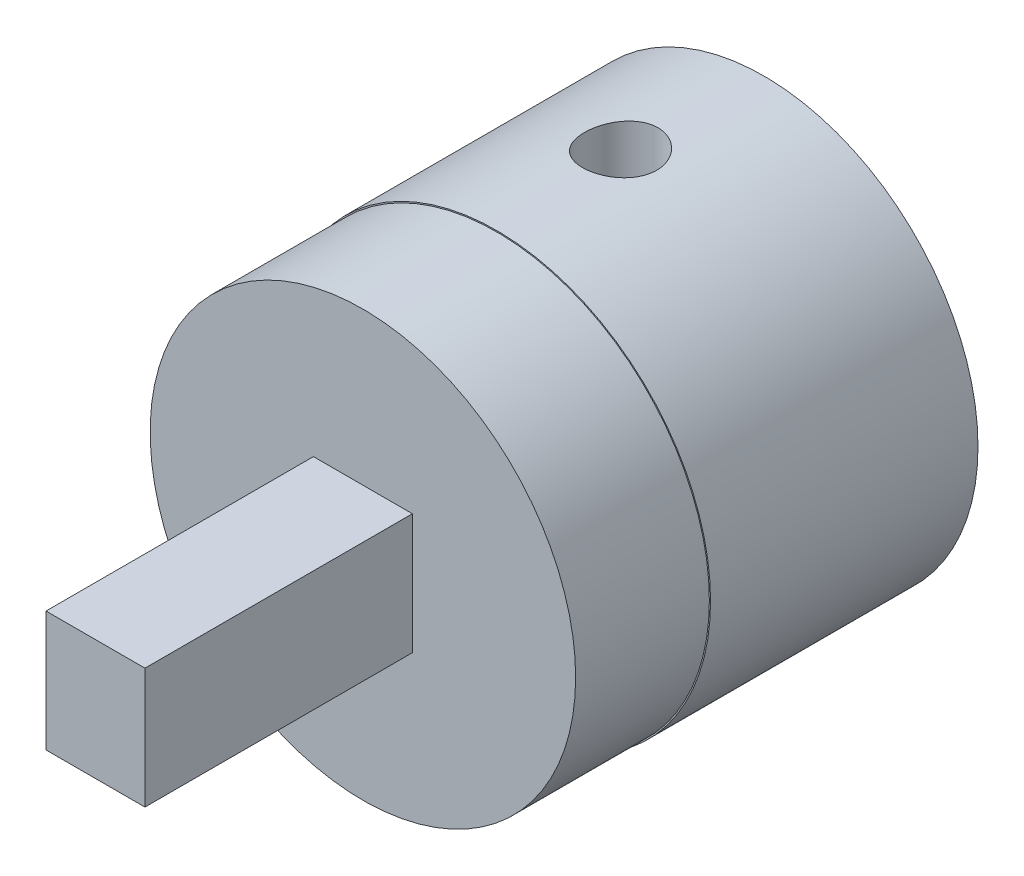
ISO-10303-21;
HEADER;
FILE_DESCRIPTION(('STEP AP214'),'2;1');
FILE_NAME('part.step','',(''),(''),'','','');
FILE_SCHEMA(('AUTOMOTIVE_DESIGN { 1 0 10303 214 1 1 1 1 }'));
ENDSEC;
DATA;
#1=APPLICATION_CONTEXT('core data for automotive mechanical design processes');
#2=APPLICATION_PROTOCOL_DEFINITION('international standard','automotive_design',2000,#1);
#3=PRODUCT_CONTEXT('',#1,'mechanical');
#4=PRODUCT('Part','Part','',(#3));
#5=PRODUCT_RELATED_PRODUCT_CATEGORY('part','',(#4));
#6=PRODUCT_DEFINITION_FORMATION('','',#4);
#7=PRODUCT_DEFINITION_CONTEXT('part definition',#1,'design');
#8=PRODUCT_DEFINITION('design','',#6,#7);
#9=PRODUCT_DEFINITION_SHAPE('','',#8);
#10=(LENGTH_UNIT() NAMED_UNIT(*) SI_UNIT(.MILLI.,.METRE.));
#11=(NAMED_UNIT(*) PLANE_ANGLE_UNIT() SI_UNIT($,.RADIAN.));
#12=(NAMED_UNIT(*) SI_UNIT($,.STERADIAN.) SOLID_ANGLE_UNIT());
#13=UNCERTAINTY_MEASURE_WITH_UNIT(LENGTH_MEASURE(1.E-05),#10,'distance_accuracy_value','');
#14=(GEOMETRIC_REPRESENTATION_CONTEXT(3) GLOBAL_UNCERTAINTY_ASSIGNED_CONTEXT((#13)) GLOBAL_UNIT_ASSIGNED_CONTEXT((#10,
#11,#12)) REPRESENTATION_CONTEXT('',''));
#15=CARTESIAN_POINT('',(0.,0.,0.));
#16=DIRECTION('',(0.,0.,1.));
#17=DIRECTION('',(1.,0.,0.));
#18=AXIS2_PLACEMENT_3D('',#15,#16,#17);
#19=CARTESIAN_POINT('',(-4.76133772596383,0.905324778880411,15.));
#20=DIRECTION('',(0.,0.,1.));
#21=DIRECTION('',(1.,0.,0.));
#22=AXIS2_PLACEMENT_3D('',#19,#20,#21);
#23=PLANE('',#22);
#24=CARTESIAN_POINT('',(-4.76133772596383,0.905324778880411,15.));
#25=DIRECTION('',(0.,0.,1.));
#26=DIRECTION('',(1.,0.,0.));
#27=AXIS2_PLACEMENT_3D('',#24,#25,#26);
#28=CIRCLE('',#27,7.95500000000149);
#29=CARTESIAN_POINT('',(3.19366227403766,0.905324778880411,15.));
#30=VERTEX_POINT('',#29);
#31=EDGE_CURVE('E119',#30,#30,#28,.T.);
#32=ORIENTED_EDGE('',*,*,#31,.T.);
#33=EDGE_LOOP('',(#32));
#34=FACE_BOUND('',#33,.T.);
#35=DIRECTION('',(-1.,0.,0.));
#36=VECTOR('',#35,1.);
#37=CARTESIAN_POINT('',(-6.61133772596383,3.15532477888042,15.));
#38=LINE('',#37,#36);
#39=CARTESIAN_POINT('',(-2.91133772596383,3.15532477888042,15.));
#40=VERTEX_POINT('',#39);
#41=CARTESIAN_POINT('',(-6.61133772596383,3.15532477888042,15.));
#42=VERTEX_POINT('',#41);
#43=EDGE_CURVE('E96',#40,#42,#38,.T.);
#44=ORIENTED_EDGE('',*,*,#43,.F.);
#45=DIRECTION('',(0.,1.,0.));
#46=VECTOR('',#45,1.);
#47=CARTESIAN_POINT('',(-2.91133772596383,3.15532477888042,15.));
#48=LINE('',#47,#46);
#49=CARTESIAN_POINT('',(-2.91133772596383,-1.34467522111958,15.));
#50=VERTEX_POINT('',#49);
#51=EDGE_CURVE('E107',#50,#40,#48,.T.);
#52=ORIENTED_EDGE('',*,*,#51,.F.);
#53=DIRECTION('',(1.,0.,0.));
#54=VECTOR('',#53,1.);
#55=CARTESIAN_POINT('',(-6.61133772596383,-1.34467522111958,15.));
#56=LINE('',#55,#54);
#57=CARTESIAN_POINT('',(-6.61133772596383,-1.34467522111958,15.));
#58=VERTEX_POINT('',#57);
#59=EDGE_CURVE('E77',#58,#50,#56,.T.);
#60=ORIENTED_EDGE('',*,*,#59,.F.);
#61=DIRECTION('',(0.,-1.,0.));
#62=VECTOR('',#61,1.);
#63=CARTESIAN_POINT('',(-6.61133772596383,3.15532477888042,15.));
#64=LINE('',#63,#62);
#65=EDGE_CURVE('E112',#42,#58,#64,.T.);
#66=ORIENTED_EDGE('',*,*,#65,.F.);
#67=EDGE_LOOP('',(#44,#52,#60,#66));
#68=FACE_BOUND('',#67,.T.);
#69=ADVANCED_FACE('F33',(#34,#68),#23,.T.);
#70=CARTESIAN_POINT('',(-4.76133772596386,0.905324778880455,10.));
#71=DIRECTION('',(0.,0.,1.));
#72=DIRECTION('',(1.,0.,0.));
#73=AXIS2_PLACEMENT_3D('',#70,#71,#72);
#74=PLANE('',#73);
#75=CARTESIAN_POINT('',(-4.76133772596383,0.905324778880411,10.));
#76=DIRECTION('',(0.,0.,1.));
#77=DIRECTION('',(1.,0.,0.));
#78=AXIS2_PLACEMENT_3D('',#75,#76,#77);
#79=CIRCLE('',#78,7.95500000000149);
#80=CARTESIAN_POINT('',(3.19366227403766,0.905324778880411,10.));
#81=VERTEX_POINT('',#80);
#82=EDGE_CURVE('E118',#81,#81,#79,.T.);
#83=ORIENTED_EDGE('',*,*,#82,.F.);
#84=EDGE_LOOP('',(#83));
#85=FACE_BOUND('',#84,.T.);
#86=CARTESIAN_POINT('',(-4.76133772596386,0.905324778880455,10.));
#87=DIRECTION('',(0.,0.,1.));
#88=DIRECTION('',(1.,0.,0.));
#89=AXIS2_PLACEMENT_3D('',#86,#87,#88);
#90=CIRCLE('',#89,8.);
#91=CARTESIAN_POINT('',(3.23866227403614,0.905324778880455,10.));
#92=VERTEX_POINT('',#91);
#93=EDGE_CURVE('E11',#92,#92,#90,.T.);
#94=ORIENTED_EDGE('',*,*,#93,.T.);
#95=EDGE_LOOP('',(#94));
#96=FACE_BOUND('',#95,.T.);
#97=ADVANCED_FACE('F172',(#85,#96),#74,.T.);
#98=CARTESIAN_POINT('',(-4.76133772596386,0.905324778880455,0.));
#99=DIRECTION('',(0.,0.,1.));
#100=DIRECTION('',(1.,0.,0.));
#101=AXIS2_PLACEMENT_3D('',#98,#99,#100);
#102=PLANE('',#101);
#103=CARTESIAN_POINT('',(-4.76133772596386,0.905324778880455,0.));
#104=DIRECTION('',(0.,0.,1.));
#105=DIRECTION('',(1.,0.,0.));
#106=AXIS2_PLACEMENT_3D('',#103,#104,#105);
#107=CIRCLE('',#106,8.);
#108=CARTESIAN_POINT('',(3.23866227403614,0.905324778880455,0.));
#109=VERTEX_POINT('',#108);
#110=EDGE_CURVE('E47',#109,#109,#107,.T.);
#111=ORIENTED_EDGE('',*,*,#110,.F.);
#112=EDGE_LOOP('',(#111));
#113=FACE_BOUND('',#112,.T.);
#114=CARTESIAN_POINT('',(-4.76133772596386,0.905324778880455,0.));
#115=DIRECTION('',(0.,0.,1.));
#116=DIRECTION('',(1.,0.,0.));
#117=AXIS2_PLACEMENT_3D('',#114,#115,#116);
#118=CIRCLE('',#117,3.);
#119=CARTESIAN_POINT('',(-1.76133772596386,0.905324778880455,0.));
#120=VERTEX_POINT('',#119);
#121=EDGE_CURVE('E127',#120,#120,#118,.T.);
#122=ORIENTED_EDGE('',*,*,#121,.T.);
#123=EDGE_LOOP('',(#122));
#124=FACE_BOUND('',#123,.T.);
#125=ADVANCED_FACE('F163',(#113,#124),#102,.F.);
#126=CARTESIAN_POINT('',(-4.76133772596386,0.905324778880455,10.));
#127=DIRECTION('',(0.,0.,-1.));
#128=DIRECTION('',(-1.,0.,0.));
#129=AXIS2_PLACEMENT_3D('',#126,#127,#128);
#130=CYLINDRICAL_SURFACE('',#129,8.);
#131=CARTESIAN_POINT('',(-5.12734854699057,-7.08629809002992,6.35));
#132=CARTESIAN_POINT('',(-5.0523915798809,-7.08972983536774,6.34999712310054));
#133=CARTESIAN_POINT('',(-4.97734751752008,-7.09210038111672,6.34373650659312));
#134=CARTESIAN_POINT('',(-4.82926426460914,-7.09473049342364,6.3188223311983));
#135=CARTESIAN_POINT('',(-4.75622677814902,-7.09498831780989,6.30015855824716));
#136=CARTESIAN_POINT('',(-4.6143240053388,-7.09363892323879,6.25097556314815));
#137=CARTESIAN_POINT('',(-4.54545627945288,-7.09203280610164,6.22046335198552));
#138=CARTESIAN_POINT('',(-4.41378964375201,-7.08739415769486,6.14846177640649));
#139=CARTESIAN_POINT('',(-4.35099008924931,-7.08436177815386,6.10697357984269));
#140=CARTESIAN_POINT('',(-4.23284674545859,-7.07742060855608,6.01392862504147));
#141=CARTESIAN_POINT('',(-4.1775459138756,-7.07350708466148,5.96231768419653));
#142=CARTESIAN_POINT('',(-4.07632575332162,-7.06545579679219,5.8506074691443));
#143=CARTESIAN_POINT('',(-4.0304070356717,-7.06131801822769,5.79050764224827));
#144=CARTESIAN_POINT('',(-3.9488941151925,-7.0534208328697,5.66296188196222));
#145=CARTESIAN_POINT('',(-3.913385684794,-7.04966472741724,5.59546088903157));
#146=CARTESIAN_POINT('',(-3.85421025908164,-7.04313489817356,5.45540916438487));
#147=CARTESIAN_POINT('',(-3.83054294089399,-7.04036114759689,5.38285857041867));
#148=CARTESIAN_POINT('',(-3.79579945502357,-7.0362143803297,5.23500196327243));
#149=CARTESIAN_POINT('',(-3.78468416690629,-7.03483701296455,5.15970527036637));
#150=CARTESIAN_POINT('',(-3.77524522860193,-7.03367045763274,5.00830381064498));
#151=CARTESIAN_POINT('',(-3.77692104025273,-7.03388120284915,4.93219907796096));
#152=CARTESIAN_POINT('',(-3.79296205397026,-7.03585342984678,4.78183938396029));
#153=CARTESIAN_POINT('',(-3.80724863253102,-7.037605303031,4.70757588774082));
#154=CARTESIAN_POINT('',(-3.84798305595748,-7.0423918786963,4.56250657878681));
#155=CARTESIAN_POINT('',(-3.8744312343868,-7.0454266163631,4.49170086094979));
#156=CARTESIAN_POINT('',(-3.93882391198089,-7.05234556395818,4.355319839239));
#157=CARTESIAN_POINT('',(-3.97680163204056,-7.05623221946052,4.28976035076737));
#158=CARTESIAN_POINT('',(-4.06316106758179,-7.06426893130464,4.16591081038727));
#159=CARTESIAN_POINT('',(-4.11154327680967,-7.06841900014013,4.10762110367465));
#160=CARTESIAN_POINT('',(-4.21771895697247,-7.07636201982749,3.9995765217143));
#161=CARTESIAN_POINT('',(-4.27557094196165,-7.08015250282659,3.949878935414));
#162=CARTESIAN_POINT('',(-4.39884627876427,-7.0866964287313,3.86089391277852));
#163=CARTESIAN_POINT('',(-4.46426942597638,-7.08944989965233,3.82160619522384));
#164=CARTESIAN_POINT('',(-4.60059898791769,-7.09334960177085,3.75469667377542));
#165=CARTESIAN_POINT('',(-4.67148575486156,-7.09450133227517,3.72703518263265));
#166=CARTESIAN_POINT('',(-4.81689722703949,-7.09481236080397,3.68399539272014));
#167=CARTESIAN_POINT('',(-4.89142165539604,-7.09397181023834,3.66861616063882));
#168=CARTESIAN_POINT('',(-5.04118661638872,-7.09012638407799,3.65066390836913));
#169=CARTESIAN_POINT('',(-5.11641265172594,-7.08714312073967,3.64796502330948));
#170=CARTESIAN_POINT('',(-5.26615655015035,-7.0790838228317,3.6550646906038));
#171=CARTESIAN_POINT('',(-5.34067441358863,-7.07400778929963,3.66486323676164));
#172=CARTESIAN_POINT('',(-5.48695554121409,-7.06203803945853,3.69662431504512));
#173=CARTESIAN_POINT('',(-5.55871731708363,-7.05514335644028,3.71859332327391));
#174=CARTESIAN_POINT('',(-5.69750330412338,-7.04001800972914,3.77402744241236));
#175=CARTESIAN_POINT('',(-5.76452707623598,-7.03178722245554,3.80749361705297));
#176=CARTESIAN_POINT('',(-5.89299416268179,-7.0144996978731,3.88554180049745));
#177=CARTESIAN_POINT('',(-5.95434243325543,-7.00543271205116,3.93027800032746));
#178=CARTESIAN_POINT('',(-6.06869843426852,-6.9873405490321,4.02938862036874));
#179=CARTESIAN_POINT('',(-6.12170547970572,-6.97831537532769,4.08376383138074));
#180=CARTESIAN_POINT('',(-6.21840044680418,-6.96102192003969,4.20128120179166));
#181=CARTESIAN_POINT('',(-6.26199154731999,-6.95276195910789,4.26450435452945));
#182=CARTESIAN_POINT('',(-6.33790248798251,-6.9378854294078,4.39756765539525));
#183=CARTESIAN_POINT('',(-6.37022321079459,-6.93126873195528,4.46740728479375));
#184=CARTESIAN_POINT('',(-6.42228298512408,-6.9203997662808,4.6108955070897));
#185=CARTESIAN_POINT('',(-6.44216193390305,-6.91612127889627,4.68449129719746));
#186=CARTESIAN_POINT('',(-6.46926712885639,-6.91024770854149,4.83407828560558));
#187=CARTESIAN_POINT('',(-6.47649517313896,-6.90865224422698,4.91006914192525));
#188=CARTESIAN_POINT('',(-6.47804353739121,-6.90831204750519,5.06064669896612));
#189=CARTESIAN_POINT('',(-6.4726216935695,-6.90951037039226,5.13523074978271));
#190=CARTESIAN_POINT('',(-6.44958123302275,-6.91451988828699,5.28239663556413));
#191=CARTESIAN_POINT('',(-6.43196274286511,-6.91833105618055,5.35497849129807));
#192=CARTESIAN_POINT('',(-6.38512835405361,-6.92818469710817,5.49598389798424));
#193=CARTESIAN_POINT('',(-6.35593337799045,-6.93422314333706,5.56441469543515));
#194=CARTESIAN_POINT('',(-6.28681185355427,-6.94796530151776,5.69543691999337));
#195=CARTESIAN_POINT('',(-6.246884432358,-6.95566914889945,5.75802787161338));
#196=CARTESIAN_POINT('',(-6.15656240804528,-6.97220589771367,5.8768655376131));
#197=CARTESIAN_POINT('',(-6.10598503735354,-6.98105731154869,5.93297076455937));
#198=CARTESIAN_POINT('',(-5.9962072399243,-6.99898953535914,6.03597858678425));
#199=CARTESIAN_POINT('',(-5.93700443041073,-7.00807040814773,6.08287863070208));
#200=CARTESIAN_POINT('',(-5.81061466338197,-7.02582567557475,6.16682917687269));
#201=CARTESIAN_POINT('',(-5.74332077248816,-7.03449187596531,6.20372049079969));
#202=CARTESIAN_POINT('',(-5.60337390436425,-7.05054835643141,6.26559951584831));
#203=CARTESIAN_POINT('',(-5.53072609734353,-7.05793984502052,6.29059854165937));
#204=CARTESIAN_POINT('',(-5.4027714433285,-7.06910174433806,6.32276649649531));
#205=CARTESIAN_POINT('',(-5.34824263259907,-7.07330790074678,6.3329574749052));
#206=CARTESIAN_POINT('',(-5.2382746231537,-7.08063588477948,6.34657520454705));
#207=CARTESIAN_POINT('',(-5.18283544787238,-7.08375774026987,6.35000212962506));
#208=CARTESIAN_POINT('',(-5.12734854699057,-7.08629809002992,6.35));
#209=B_SPLINE_CURVE_WITH_KNOTS('',3,(#131,#132,#133,#134,#135,#136,#137,#138,#139,#140,#141,
#142,#143,#144,#145,#146,#147,#148,#149,#150,#151,#152,#153,#154,#155,#156,#157,#158,#159,#160,
#161,#162,#163,#164,#165,#166,#167,#168,#169,#170,#171,#172,#173,#174,#175,#176,#177,#178,#179,
#180,#181,#182,#183,#184,#185,#186,#187,#188,#189,#190,#191,#192,#193,#194,#195,#196,#197,#198,
#199,#200,#201,#202,#203,#204,#205,#206,#207,#208),.UNSPECIFIED.,.T.,.F.,(4,2,2,2,2,2,2,2,2,2,2,
2,2,2,2,2,2,2,2,2,2,2,2,2,2,2,2,2,2,2,2,2,2,2,2,2,2,2,4),(0.,0.22490521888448,0.449995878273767,
0.674953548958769,0.899887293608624,1.12605959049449,1.35224661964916,1.58024800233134,
1.808243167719,2.03552577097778,2.26279881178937,2.4886648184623,2.71453702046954,
2.94106632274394,3.16760637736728,3.395603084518,3.62359363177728,3.85079946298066,
4.07798802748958,4.3029166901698,4.5278452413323,4.75289359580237,4.97796277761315,
5.20629652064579,5.434649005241,5.66524822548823,5.89582938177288,6.12376893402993,
6.35167608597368,6.57497861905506,6.79827883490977,7.02117729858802,7.24409389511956,
7.47120372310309,7.69837640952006,7.92897469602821,8.15935314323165,8.32584352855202,
8.49232963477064),.UNSPECIFIED.);
#210=CARTESIAN_POINT('',(-5.12734854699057,-7.08629809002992,6.35));
#211=VERTEX_POINT('',#210);
#212=EDGE_CURVE('E110',#211,#211,#209,.T.);
#213=ORIENTED_EDGE('',*,*,#212,.T.);
#214=EDGE_LOOP('',(#213));
#215=FACE_BOUND('',#214,.T.);
#216=CARTESIAN_POINT('',(-5.12734854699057,8.89694764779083,6.35));
#217=CARTESIAN_POINT('',(-5.20301961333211,8.89348059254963,6.34999688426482));
#218=CARTESIAN_POINT('',(-5.27868412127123,8.88892822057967,6.34361594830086));
#219=CARTESIAN_POINT('',(-5.42778941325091,8.8778681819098,6.31831907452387));
#220=CARTESIAN_POINT('',(-5.5012278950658,8.87135856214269,6.29939059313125));
#221=CARTESIAN_POINT('',(-5.64370840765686,8.85683696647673,6.24962375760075));
#222=CARTESIAN_POINT('',(-5.71275485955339,8.8488265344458,6.21879760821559));
#223=CARTESIAN_POINT('',(-5.84465456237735,8.83191620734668,6.14614226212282));
#224=CARTESIAN_POINT('',(-5.90750854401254,8.82301641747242,6.10431436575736));
#225=CARTESIAN_POINT('',(-6.02603822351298,8.80495592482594,6.01026939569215));
#226=CARTESIAN_POINT('',(-6.08162475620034,8.79579340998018,5.95794023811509));
#227=CARTESIAN_POINT('',(-6.18324977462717,8.77811546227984,5.84460980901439));
#228=CARTESIAN_POINT('',(-6.22928774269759,8.76960006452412,5.78360806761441));
#229=CARTESIAN_POINT('',(-6.31060099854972,8.75398760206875,5.65441111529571));
#230=CARTESIAN_POINT('',(-6.34584779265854,8.74689430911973,5.58619748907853));
#231=CARTESIAN_POINT('',(-6.40432649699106,8.73485129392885,5.44462430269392));
#232=CARTESIAN_POINT('',(-6.42755995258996,8.72990129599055,5.37126540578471));
#233=CARTESIAN_POINT('',(-6.46095449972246,8.72271513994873,5.22287934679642));
#234=CARTESIAN_POINT('',(-6.47134133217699,8.72043215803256,5.14790526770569));
#235=CARTESIAN_POINT('',(-6.47945127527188,8.71865343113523,4.99724631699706));
#236=CARTESIAN_POINT('',(-6.47717576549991,8.71915738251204,4.92156152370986));
#237=CARTESIAN_POINT('',(-6.46017788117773,8.722870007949,4.77289762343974));
#238=CARTESIAN_POINT('',(-6.44565372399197,8.72603560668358,4.69989463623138));
#239=CARTESIAN_POINT('',(-6.40488078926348,8.7347051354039,4.55738866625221));
#240=CARTESIAN_POINT('',(-6.37863148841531,8.74020916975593,4.48788583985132));
#241=CARTESIAN_POINT('',(-6.31495460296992,8.75308447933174,4.35374427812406));
#242=CARTESIAN_POINT('',(-6.27744346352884,8.76046964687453,4.28914658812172));
#243=CARTESIAN_POINT('',(-6.19238640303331,8.77640898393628,4.16709604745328));
#244=CARTESIAN_POINT('',(-6.14483925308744,8.78496329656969,4.10964407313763));
#245=CARTESIAN_POINT('',(-6.0399113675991,8.80267446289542,4.0022627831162));
#246=CARTESIAN_POINT('',(-5.98234745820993,8.81184012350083,3.95251379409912));
#247=CARTESIAN_POINT('',(-5.85965437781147,8.82981461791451,3.86334709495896));
#248=CARTESIAN_POINT('',(-5.794524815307,8.8386234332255,3.82392991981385));
#249=CARTESIAN_POINT('',(-5.65796474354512,8.85521905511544,3.75629870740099));
#250=CARTESIAN_POINT('',(-5.58649210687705,8.86299801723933,3.7281676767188));
#251=CARTESIAN_POINT('',(-5.4396630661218,8.87685581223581,3.68439103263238));
#252=CARTESIAN_POINT('',(-5.36430699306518,8.88293478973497,3.66874435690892));
#253=CARTESIAN_POINT('',(-5.21285461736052,8.89292882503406,3.65058080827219));
#254=CARTESIAN_POINT('',(-5.1367796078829,8.89687018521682,3.64790097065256));
#255=CARTESIAN_POINT('',(-4.98518035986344,8.90255224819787,3.65536380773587));
#256=CARTESIAN_POINT('',(-4.90965607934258,8.90429312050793,3.66550549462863));
#257=CARTESIAN_POINT('',(-4.76230154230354,8.90566003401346,3.6981304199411));
#258=CARTESIAN_POINT('',(-4.69043684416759,8.90531231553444,3.72045733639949));
#259=CARTESIAN_POINT('',(-4.55143258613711,8.90287292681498,3.7767082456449));
#260=CARTESIAN_POINT('',(-4.48429312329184,8.90078122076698,3.81063247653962));
#261=CARTESIAN_POINT('',(-4.35641883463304,8.89532816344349,3.88922707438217));
#262=CARTESIAN_POINT('',(-4.29570335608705,8.89196310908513,3.93392864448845));
#263=CARTESIAN_POINT('',(-4.18256406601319,8.88456293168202,4.03277412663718));
#264=CARTESIAN_POINT('',(-4.13014076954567,8.88052776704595,4.08691862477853));
#265=CARTESIAN_POINT('',(-4.03454515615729,8.872388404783,4.20373826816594));
#266=CARTESIAN_POINT('',(-3.99146933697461,8.86828391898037,4.2664923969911));
#267=CARTESIAN_POINT('',(-3.91644325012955,8.86067399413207,4.3983662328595));
#268=CARTESIAN_POINT('',(-3.88449296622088,8.85716855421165,4.46748593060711));
#269=CARTESIAN_POINT('',(-3.83261408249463,8.85127716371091,4.61021435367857));
#270=CARTESIAN_POINT('',(-3.81269583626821,8.84889217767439,4.68382688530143));
#271=CARTESIAN_POINT('',(-3.78551592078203,8.84559946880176,4.83338366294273));
#272=CARTESIAN_POINT('',(-3.77825363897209,8.84469167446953,4.90932779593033));
#273=CARTESIAN_POINT('',(-3.77660833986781,8.84448773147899,5.06082886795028));
#274=CARTESIAN_POINT('',(-3.78213635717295,8.84518045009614,5.13638483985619));
#275=CARTESIAN_POINT('',(-3.80572252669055,8.84805343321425,5.28548476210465));
#276=CARTESIAN_POINT('',(-3.82378071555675,8.85023370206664,5.35902870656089));
#277=CARTESIAN_POINT('',(-3.87188099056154,8.85576173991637,5.50198109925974));
#278=CARTESIAN_POINT('',(-3.90191485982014,8.85910870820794,5.57139234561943));
#279=CARTESIAN_POINT('',(-3.97311086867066,8.8664788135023,5.70421111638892));
#280=CARTESIAN_POINT('',(-4.01427327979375,8.87050196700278,5.76761849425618));
#281=CARTESIAN_POINT('',(-4.10689954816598,8.87864784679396,5.88709431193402));
#282=CARTESIAN_POINT('',(-4.15843179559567,8.88277106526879,5.94310970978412));
#283=CARTESIAN_POINT('',(-4.27020029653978,8.89043057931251,6.04573080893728));
#284=CARTESIAN_POINT('',(-4.33043822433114,8.89396676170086,6.09233469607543));
#285=CARTESIAN_POINT('',(-4.45799834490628,8.8998268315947,6.17483977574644));
#286=CARTESIAN_POINT('',(-4.52532887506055,8.90214927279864,6.21072817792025));
#287=CARTESIAN_POINT('',(-4.66505590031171,8.90504937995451,6.27065033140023));
#288=CARTESIAN_POINT('',(-4.73744718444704,8.9056288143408,6.29469607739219));
#289=CARTESIAN_POINT('',(-4.86301879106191,8.90484659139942,6.32494019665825));
#290=CARTESIAN_POINT('',(-4.91545776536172,8.90401441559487,6.33432716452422));
#291=CARTESIAN_POINT('',(-5.02104842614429,8.90128250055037,6.34685812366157));
#292=CARTESIAN_POINT('',(-5.07420010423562,8.89938277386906,6.35000218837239));
#293=CARTESIAN_POINT('',(-5.12734854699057,8.89694764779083,6.35));
#294=B_SPLINE_CURVE_WITH_KNOTS('',3,(#216,#217,#218,#219,#220,#221,#222,#223,#224,#225,#226,
#227,#228,#229,#230,#231,#232,#233,#234,#235,#236,#237,#238,#239,#240,#241,#242,#243,#244,#245,
#246,#247,#248,#249,#250,#251,#252,#253,#254,#255,#256,#257,#258,#259,#260,#261,#262,#263,#264,
#265,#266,#267,#268,#269,#270,#271,#272,#273,#274,#275,#276,#277,#278,#279,#280,#281,#282,#283,
#284,#285,#286,#287,#288,#289,#290,#291,#292,#293),.UNSPECIFIED.,.T.,.F.,(4,2,2,2,2,2,2,2,2,2,2,
2,2,2,2,2,2,2,2,2,2,2,2,2,2,2,2,2,2,2,2,2,2,2,2,2,2,2,4),(0.,0.227055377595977,
0.454338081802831,0.681388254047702,0.908411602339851,1.13800096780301,1.36760277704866,
1.59780571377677,1.82797903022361,2.054047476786,2.28009129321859,2.50254576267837,
2.72501016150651,2.94916768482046,3.17335267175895,3.40217806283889,3.6310153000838,
3.86150600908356,4.09197710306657,4.31954402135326,4.54709340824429,4.77178997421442,
4.99649115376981,5.22185088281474,5.44722460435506,5.67482459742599,5.90242425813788,
6.13021949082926,6.35800369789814,6.58420827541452,6.8104135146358,7.0364638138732,
7.26251962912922,7.49011827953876,7.71776076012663,7.94567388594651,8.17335569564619,
8.33283252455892,8.49230747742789),.UNSPECIFIED.);
#295=CARTESIAN_POINT('',(-5.12734854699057,8.89694764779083,6.35));
#296=VERTEX_POINT('',#295);
#297=EDGE_CURVE('E151',#296,#296,#294,.T.);
#298=ORIENTED_EDGE('',*,*,#297,.T.);
#299=EDGE_LOOP('',(#298));
#300=FACE_BOUND('',#299,.T.);
#301=ORIENTED_EDGE('',*,*,#93,.F.);
#302=EDGE_LOOP('',(#301));
#303=FACE_BOUND('',#302,.T.);
#304=ORIENTED_EDGE('',*,*,#110,.T.);
#305=EDGE_LOOP('',(#304));
#306=FACE_BOUND('',#305,.T.);
#307=ADVANCED_FACE('F35',(#215,#300,#303,#306),#130,.T.);
#308=CARTESIAN_POINT('',(-4.76133772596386,0.905324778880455,10.));
#309=DIRECTION('',(0.,0.,-1.));
#310=DIRECTION('',(-1.,0.,0.));
#311=AXIS2_PLACEMENT_3D('',#308,#309,#310);
#312=CYLINDRICAL_SURFACE('',#311,3.);
#313=CARTESIAN_POINT('',(-5.12734854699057,-2.0722641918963,6.35));
#314=CARTESIAN_POINT('',(-5.05733567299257,-2.08086705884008,6.34999605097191));
#315=CARTESIAN_POINT('',(-4.98696056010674,-2.0869896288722,6.34452721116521));
#316=CARTESIAN_POINT('',(-4.84763434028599,-2.09424751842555,6.32258999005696));
#317=CARTESIAN_POINT('',(-4.77868483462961,-2.09537750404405,6.30610986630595));
#318=CARTESIAN_POINT('',(-4.64441101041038,-2.09314654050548,6.2626328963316));
#319=CARTESIAN_POINT('',(-4.5790803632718,-2.08979370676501,6.23565511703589));
#320=CARTESIAN_POINT('',(-4.45365747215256,-2.07952004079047,6.17200257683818));
#321=CARTESIAN_POINT('',(-4.39356552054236,-2.07259900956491,6.13532727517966));
#322=CARTESIAN_POINT('',(-4.27840429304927,-2.05613715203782,6.05213205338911));
#323=CARTESIAN_POINT('',(-4.22352523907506,-2.04652774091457,6.00536294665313));
#324=CARTESIAN_POINT('',(-4.12197742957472,-2.02621154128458,5.90381924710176));
#325=CARTESIAN_POINT('',(-4.07531171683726,-2.01550434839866,5.8490417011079));
#326=CARTESIAN_POINT('',(-3.98869331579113,-1.99383646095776,5.72921260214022));
#327=CARTESIAN_POINT('',(-3.94931337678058,-1.98289926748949,5.66374121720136));
#328=CARTESIAN_POINT('',(-3.88205343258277,-1.96314076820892,5.52683441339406));
#329=CARTESIAN_POINT('',(-3.85417210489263,-1.95431921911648,5.45539968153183));
#330=CARTESIAN_POINT('',(-3.81102486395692,-1.94027211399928,5.30911949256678));
#331=CARTESIAN_POINT('',(-3.79565450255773,-1.93501684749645,5.23430789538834));
#332=CARTESIAN_POINT('',(-3.77775264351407,-1.92886908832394,5.08299987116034));
#333=CARTESIAN_POINT('',(-3.77521612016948,-1.92797488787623,5.00650411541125));
#334=CARTESIAN_POINT('',(-3.78287390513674,-1.93062636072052,4.85812696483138));
#335=CARTESIAN_POINT('',(-3.79243186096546,-1.93395013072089,4.78620760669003));
#336=CARTESIAN_POINT('',(-3.82284345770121,-1.94414575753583,4.64506337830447));
#337=CARTESIAN_POINT('',(-3.84369865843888,-1.95101810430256,4.5758388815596));
#338=CARTESIAN_POINT('',(-3.89625173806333,-1.96737164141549,4.4412829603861));
#339=CARTESIAN_POINT('',(-3.92804198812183,-1.97687491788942,4.37599045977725));
#340=CARTESIAN_POINT('',(-4.00155210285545,-1.99711827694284,4.25145862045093));
#341=CARTESIAN_POINT('',(-4.04327515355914,-2.00785875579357,4.19222123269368));
#342=CARTESIAN_POINT('',(-4.13807382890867,-2.02964086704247,4.07825819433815));
#343=CARTESIAN_POINT('',(-4.19162514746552,-2.04066932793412,4.02392456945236));
#344=CARTESIAN_POINT('',(-4.30733697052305,-2.06070369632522,3.92488195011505));
#345=CARTESIAN_POINT('',(-4.36949725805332,-2.06970965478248,3.88017271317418));
#346=CARTESIAN_POINT('',(-4.50042964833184,-2.0840283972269,3.80198092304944));
#347=CARTESIAN_POINT('',(-4.56916057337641,-2.0893626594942,3.76843368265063));
#348=CARTESIAN_POINT('',(-4.71147339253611,-2.09510378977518,3.71339217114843));
#349=CARTESIAN_POINT('',(-4.78505254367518,-2.09551342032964,3.69189114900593));
#350=CARTESIAN_POINT('',(-4.92977325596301,-2.09076131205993,3.66262918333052));
#351=CARTESIAN_POINT('',(-5.00076660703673,-2.08595669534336,3.65407250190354));
#352=CARTESIAN_POINT('',(-5.14267050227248,-2.07119526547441,3.64822083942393));
#353=CARTESIAN_POINT('',(-5.21358105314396,-2.06123890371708,3.65092487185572));
#354=CARTESIAN_POINT('',(-5.35178887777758,-2.03681615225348,3.66700793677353));
#355=CARTESIAN_POINT('',(-5.41913083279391,-2.02244944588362,3.68016032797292));
#356=CARTESIAN_POINT('',(-5.55019341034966,-1.98989054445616,3.71612923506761));
#357=CARTESIAN_POINT('',(-5.61391326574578,-1.971697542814,3.73894778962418));
#358=CARTESIAN_POINT('',(-5.74081102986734,-1.93111221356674,3.79529424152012));
#359=CARTESIAN_POINT('',(-5.80363937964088,-1.90851518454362,3.82945950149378));
#360=CARTESIAN_POINT('',(-5.92271119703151,-1.8614997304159,3.90686295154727));
#361=CARTESIAN_POINT('',(-5.97894937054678,-1.83707986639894,3.95010835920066));
#362=CARTESIAN_POINT('',(-6.08945997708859,-1.78543496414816,4.04976584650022));
#363=CARTESIAN_POINT('',(-6.14290702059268,-1.75818443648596,4.10708333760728));
#364=CARTESIAN_POINT('',(-6.23948153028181,-1.70582627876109,4.23071057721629));
#365=CARTESIAN_POINT('',(-6.28261305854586,-1.68071780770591,4.29701676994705));
#366=CARTESIAN_POINT('',(-6.351195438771,-1.63902222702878,4.42627260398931));
#367=CARTESIAN_POINT('',(-6.37836851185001,-1.62171480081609,4.48807334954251));
#368=CARTESIAN_POINT('',(-6.4233997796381,-1.59232967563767,4.61614300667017));
#369=CARTESIAN_POINT('',(-6.44126810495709,-1.58024629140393,4.68240696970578));
#370=CARTESIAN_POINT('',(-6.46684262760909,-1.56277229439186,4.81819722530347));
#371=CARTESIAN_POINT('',(-6.47448615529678,-1.55742296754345,4.8877409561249));
#372=CARTESIAN_POINT('',(-6.47887513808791,-1.55436535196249,5.02733824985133));
#373=CARTESIAN_POINT('',(-6.47562349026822,-1.55665503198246,5.09739167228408));
#374=CARTESIAN_POINT('',(-6.45933115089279,-1.5679111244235,5.22859241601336));
#375=CARTESIAN_POINT('',(-6.44729982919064,-1.57618836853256,5.28993081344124));
#376=CARTESIAN_POINT('',(-6.41521644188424,-1.59768444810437,5.40955409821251));
#377=CARTESIAN_POINT('',(-6.39516148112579,-1.61090506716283,5.46783787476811));
#378=CARTESIAN_POINT('',(-6.34610952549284,-1.64210471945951,5.58428809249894));
#379=CARTESIAN_POINT('',(-6.31658174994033,-1.6603535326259,5.64215651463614));
#380=CARTESIAN_POINT('',(-6.25006578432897,-1.69951274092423,5.75243488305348));
#381=CARTESIAN_POINT('',(-6.21307387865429,-1.72042445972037,5.80484209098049));
#382=CARTESIAN_POINT('',(-6.12549958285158,-1.7671121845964,5.91200849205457));
#383=CARTESIAN_POINT('',(-6.07367636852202,-1.79311183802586,5.96566032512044));
#384=CARTESIAN_POINT('',(-5.96176643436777,-1.84472465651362,6.06385802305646));
#385=CARTESIAN_POINT('',(-5.90167168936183,-1.87033741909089,6.10839493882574));
#386=CARTESIAN_POINT('',(-5.76943135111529,-1.92118091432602,6.19026253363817));
#387=CARTESIAN_POINT('',(-5.69671788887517,-1.94623596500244,6.22679251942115));
#388=CARTESIAN_POINT('',(-5.54472820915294,-1.99166452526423,6.28643778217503));
#389=CARTESIAN_POINT('',(-5.46546837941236,-2.01204927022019,6.30958546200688));
#390=CARTESIAN_POINT('',(-5.34220999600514,-2.03821832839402,6.33348079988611));
#391=CARTESIAN_POINT('',(-5.29968576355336,-2.04629725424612,6.33964758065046));
#392=CARTESIAN_POINT('',(-5.21393687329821,-2.06065605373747,6.34790847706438));
#393=CARTESIAN_POINT('',(-5.1707121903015,-2.06693586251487,6.35000244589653));
#394=CARTESIAN_POINT('',(-5.12734854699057,-2.0722641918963,6.35));
#395=B_SPLINE_CURVE_WITH_KNOTS('',3,(#313,#314,#315,#316,#317,#318,#319,#320,#321,#322,#323,
#324,#325,#326,#327,#328,#329,#330,#331,#332,#333,#334,#335,#336,#337,#338,#339,#340,#341,#342,
#343,#344,#345,#346,#347,#348,#349,#350,#351,#352,#353,#354,#355,#356,#357,#358,#359,#360,#361,
#362,#363,#364,#365,#366,#367,#368,#369,#370,#371,#372,#373,#374,#375,#376,#377,#378,#379,#380,
#381,#382,#383,#384,#385,#386,#387,#388,#389,#390,#391,#392,#393,#394),.UNSPECIFIED.,.T.,.F.,(4,
2,2,2,2,2,2,2,2,2,2,2,2,2,2,2,2,2,2,2,2,2,2,2,2,2,2,2,2,2,2,2,2,2,2,2,2,2,2,2,4),(0.,
0.211453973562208,0.42313380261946,0.634430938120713,0.845739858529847,1.06302764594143,
1.28039576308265,1.51084074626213,1.74125921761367,1.96973371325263,2.19811873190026,
2.41497187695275,2.63185497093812,2.8506170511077,3.06944939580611,3.29960429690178,
3.52975339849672,3.7585444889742,3.98720722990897,4.20114306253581,4.41506015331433,
4.62445972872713,4.83390348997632,5.05799492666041,5.28226516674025,5.53006686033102,
5.77777081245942,5.98600192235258,6.19400584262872,6.40327890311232,6.61249632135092,
6.80083310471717,6.98923790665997,7.1909266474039,7.39271603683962,7.62871330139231,
7.8649411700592,8.11905085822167,8.37254266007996,8.50350549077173,8.63447304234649),.UNSPECIFIED.);
#396=CARTESIAN_POINT('',(-5.12734854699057,-2.0722641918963,6.35));
#397=VERTEX_POINT('',#396);
#398=EDGE_CURVE('E38',#397,#397,#395,.T.);
#399=ORIENTED_EDGE('',*,*,#398,.F.);
#400=EDGE_LOOP('',(#399));
#401=FACE_BOUND('',#400,.T.);
#402=CARTESIAN_POINT('',(-5.12734854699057,3.88291374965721,6.35));
#403=CARTESIAN_POINT('',(-5.20158081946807,3.87378203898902,6.3499913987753));
#404=CARTESIAN_POINT('',(-5.27558114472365,3.86184131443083,6.34383972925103));
#405=CARTESIAN_POINT('',(-5.4207501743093,3.83289968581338,6.31979676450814));
#406=CARTESIAN_POINT('',(-5.49191007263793,3.81588425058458,6.30187157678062));
#407=CARTESIAN_POINT('',(-5.62910657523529,3.77795694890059,6.25537119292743));
#408=CARTESIAN_POINT('',(-5.6951670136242,3.75706498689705,6.22684968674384));
#409=CARTESIAN_POINT('',(-5.82122246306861,3.71265732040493,6.160226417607));
#410=CARTESIAN_POINT('',(-5.88121953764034,3.68914251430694,6.1221279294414));
#411=CARTESIAN_POINT('',(-5.99866793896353,3.63907663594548,6.03397662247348));
#412=CARTESIAN_POINT('',(-6.05555293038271,3.61243194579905,5.98322177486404));
#413=CARTESIAN_POINT('',(-6.16021982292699,3.55986166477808,5.8726290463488));
#414=CARTESIAN_POINT('',(-6.20799206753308,3.53393686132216,5.81278164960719));
#415=CARTESIAN_POINT('',(-6.29537465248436,3.48396587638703,5.68170814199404));
#416=CARTESIAN_POINT('',(-6.33445128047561,3.46008057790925,5.61006015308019));
#417=CARTESIAN_POINT('',(-6.39945010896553,3.41890479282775,5.45930702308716));
#418=CARTESIAN_POINT('',(-6.42539607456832,3.40160240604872,5.38021566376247));
#419=CARTESIAN_POINT('',(-6.46009085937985,3.37810188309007,5.22728178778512));
#420=CARTESIAN_POINT('',(-6.47057714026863,3.37079035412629,5.15400982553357));
#421=CARTESIAN_POINT('',(-6.47935005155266,3.36468869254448,5.006410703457));
#422=CARTESIAN_POINT('',(-6.47764830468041,3.36589044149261,4.93208461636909));
#423=CARTESIAN_POINT('',(-6.46335107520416,3.37579029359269,4.7960870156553));
#424=CARTESIAN_POINT('',(-6.45237955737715,3.38337023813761,4.73415005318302));
#425=CARTESIAN_POINT('',(-6.42224702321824,3.40366592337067,4.61318656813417));
#426=CARTESIAN_POINT('',(-6.40308301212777,3.41638354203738,4.55416111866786));
#427=CARTESIAN_POINT('',(-6.35603884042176,3.44653446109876,4.4369440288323));
#428=CARTESIAN_POINT('',(-6.32773127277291,3.4641916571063,4.37898350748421));
#429=CARTESIAN_POINT('',(-6.2636883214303,3.50230985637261,4.26834211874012));
#430=CARTESIAN_POINT('',(-6.22794930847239,3.5227722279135,4.21566384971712));
#431=CARTESIAN_POINT('',(-6.14312038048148,3.56866378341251,4.10770797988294));
#432=CARTESIAN_POINT('',(-6.09279403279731,3.59434655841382,4.05350630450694));
#433=CARTESIAN_POINT('',(-5.98392514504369,3.64556267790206,3.95394870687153));
#434=CARTESIAN_POINT('',(-5.92537674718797,3.67109590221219,3.90859914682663));
#435=CARTESIAN_POINT('',(-5.79574423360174,3.72228310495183,3.82432348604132));
#436=CARTESIAN_POINT('',(-5.72401775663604,3.74776313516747,3.78627014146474));
#437=CARTESIAN_POINT('',(-5.57367929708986,3.79431716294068,3.72331802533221));
#438=CARTESIAN_POINT('',(-5.49507164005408,3.81539390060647,3.69841105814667));
#439=CARTESIAN_POINT('',(-5.33895689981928,3.85020114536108,3.66446761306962));
#440=CARTESIAN_POINT('',(-5.26175863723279,3.86434291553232,3.65444139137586));
#441=CARTESIAN_POINT('',(-5.10593622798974,3.88650379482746,3.64792417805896));
#442=CARTESIAN_POINT('',(-5.02731314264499,3.89452728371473,3.65142349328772));
#443=CARTESIAN_POINT('',(-4.87923661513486,3.9038344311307,3.67110527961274));
#444=CARTESIAN_POINT('',(-4.80964501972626,3.90570593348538,3.68599979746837));
#445=CARTESIAN_POINT('',(-4.67370244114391,3.90481473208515,3.72652658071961));
#446=CARTESIAN_POINT('',(-4.6073513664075,3.9020521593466,3.75215854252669));
#447=CARTESIAN_POINT('',(-4.48031219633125,3.89280702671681,3.81308621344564));
#448=CARTESIAN_POINT('',(-4.41957745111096,3.88635906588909,3.84829046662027));
#449=CARTESIAN_POINT('',(-4.30449726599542,3.87090607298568,3.92748042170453));
#450=CARTESIAN_POINT('',(-4.25015365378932,3.86190031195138,3.97146862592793));
#451=CARTESIAN_POINT('',(-4.14589684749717,3.84202732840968,4.0701006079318));
#452=CARTESIAN_POINT('',(-4.09646085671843,3.8310797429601,4.12523294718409));
#453=CARTESIAN_POINT('',(-4.00721942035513,3.80935992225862,4.24285815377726));
#454=CARTESIAN_POINT('',(-3.96741688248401,3.79858774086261,4.30535323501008));
#455=CARTESIAN_POINT('',(-3.89716247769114,3.77840551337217,4.43872289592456));
#456=CARTESIAN_POINT('',(-3.86712066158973,3.76906229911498,4.50982484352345));
#457=CARTESIAN_POINT('',(-3.81952805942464,3.75376774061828,4.65643205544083));
#458=CARTESIAN_POINT('',(-3.80197210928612,3.74781499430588,4.73193548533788));
#459=CARTESIAN_POINT('',(-3.78044806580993,3.74045814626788,4.88213089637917));
#460=CARTESIAN_POINT('',(-3.77598758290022,3.73888932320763,4.95674412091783));
#461=CARTESIAN_POINT('',(-3.77943034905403,3.74008431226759,5.10564182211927));
#462=CARTESIAN_POINT('',(-3.78733181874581,3.74284750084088,5.17992634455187));
#463=CARTESIAN_POINT('',(-3.81469636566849,3.75208871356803,5.32341635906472));
#464=CARTESIAN_POINT('',(-3.83375350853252,3.75843604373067,5.39270866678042));
#465=CARTESIAN_POINT('',(-3.88246592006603,3.77381439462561,5.52714520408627));
#466=CARTESIAN_POINT('',(-3.9121238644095,3.78284609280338,5.59228838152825));
#467=CARTESIAN_POINT('',(-3.98253191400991,3.80271069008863,5.71928025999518));
#468=CARTESIAN_POINT('',(-4.02365931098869,3.81359881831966,5.78091099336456));
#469=CARTESIAN_POINT('',(-4.1154285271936,3.83534546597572,5.89664600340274));
#470=CARTESIAN_POINT('',(-4.16607219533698,3.84620397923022,5.95074881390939));
#471=CARTESIAN_POINT('',(-4.27776335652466,3.86665774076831,6.05194634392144));
#472=CARTESIAN_POINT('',(-4.33912805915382,3.8761908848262,6.09870504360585));
#473=CARTESIAN_POINT('',(-4.46928233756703,3.89179242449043,6.18126311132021));
#474=CARTESIAN_POINT('',(-4.5380731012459,3.89786026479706,6.21706072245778));
#475=CARTESIAN_POINT('',(-4.6782206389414,3.90496232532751,6.27527294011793));
#476=CARTESIAN_POINT('',(-4.74937520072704,3.90618218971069,6.29815169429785));
#477=CARTESIAN_POINT('',(-4.8942560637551,3.90324806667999,6.33179102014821));
#478=CARTESIAN_POINT('',(-4.96797477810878,3.89910880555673,6.34258464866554));
#479=CARTESIAN_POINT('',(-5.07025996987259,3.88951746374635,6.34909938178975));
#480=CARTESIAN_POINT('',(-5.09882138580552,3.88642302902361,6.35000330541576));
#481=CARTESIAN_POINT('',(-5.12734854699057,3.88291374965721,6.35));
#482=B_SPLINE_CURVE_WITH_KNOTS('',3,(#402,#403,#404,#405,#406,#407,#408,#409,#410,#411,#412,
#413,#414,#415,#416,#417,#418,#419,#420,#421,#422,#423,#424,#425,#426,#427,#428,#429,#430,#431,
#432,#433,#434,#435,#436,#437,#438,#439,#440,#441,#442,#443,#444,#445,#446,#447,#448,#449,#450,
#451,#452,#453,#454,#455,#456,#457,#458,#459,#460,#461,#462,#463,#464,#465,#466,#467,#468,#469,
#470,#471,#472,#473,#474,#475,#476,#477,#478,#479,#480,#481),.UNSPECIFIED.,.T.,.F.,(4,2,2,2,2,2,
2,2,2,2,2,2,2,2,2,2,2,2,2,2,2,2,2,2,2,2,2,2,2,2,2,2,2,2,2,2,2,2,2,4),(0.,0.224289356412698,
0.449227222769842,0.673040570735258,0.896777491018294,1.13801741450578,1.37951157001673,
1.63319569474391,1.88641902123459,2.10814938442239,2.32966832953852,2.51889986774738,
2.70820063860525,2.90808499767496,3.10806720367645,3.34198637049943,3.57607304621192,
3.83004237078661,4.08385317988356,4.31987973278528,4.55573716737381,4.76827955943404,
4.98081594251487,5.19138902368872,5.40202217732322,5.62559394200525,5.84923310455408,
6.08132083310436,6.31331251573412,6.53646197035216,6.75957930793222,6.97504233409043,
7.19055978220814,7.41423315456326,7.6379500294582,7.86999827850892,8.10208370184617,
8.32519093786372,8.54768639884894,8.63387988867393),.UNSPECIFIED.);
#483=CARTESIAN_POINT('',(-5.12734854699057,3.88291374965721,6.35));
#484=VERTEX_POINT('',#483);
#485=EDGE_CURVE('E131',#484,#484,#482,.T.);
#486=ORIENTED_EDGE('',*,*,#485,.F.);
#487=EDGE_LOOP('',(#486));
#488=FACE_BOUND('',#487,.T.);
#489=CARTESIAN_POINT('',(-4.76133772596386,0.905324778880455,10.));
#490=DIRECTION('',(0.,0.,1.));
#491=DIRECTION('',(1.,0.,0.));
#492=AXIS2_PLACEMENT_3D('',#489,#490,#491);
#493=CIRCLE('',#492,3.);
#494=CARTESIAN_POINT('',(-1.76133772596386,0.905324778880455,10.));
#495=VERTEX_POINT('',#494);
#496=EDGE_CURVE('E122',#495,#495,#493,.T.);
#497=ORIENTED_EDGE('',*,*,#496,.T.);
#498=EDGE_LOOP('',(#497));
#499=FACE_BOUND('',#498,.T.);
#500=ORIENTED_EDGE('',*,*,#121,.F.);
#501=EDGE_LOOP('',(#500));
#502=FACE_BOUND('',#501,.T.);
#503=ADVANCED_FACE('F135',(#401,#488,#499,#502),#312,.F.);
#504=CARTESIAN_POINT('',(-4.76133772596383,0.905324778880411,10.));
#505=DIRECTION('',(0.,0.,1.));
#506=DIRECTION('',(1.,0.,0.));
#507=AXIS2_PLACEMENT_3D('',#504,#505,#506);
#508=PLANE('',#507);
#509=ORIENTED_EDGE('',*,*,#496,.F.);
#510=EDGE_LOOP('',(#509));
#511=FACE_BOUND('',#510,.T.);
#512=ADVANCED_FACE('F176',(#511),#508,.F.);
#513=CARTESIAN_POINT('',(-4.76133772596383,0.905324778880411,15.));
#514=DIRECTION('',(0.,0.,-1.));
#515=DIRECTION('',(-1.,0.,0.));
#516=AXIS2_PLACEMENT_3D('',#513,#514,#515);
#517=CYLINDRICAL_SURFACE('',#516,7.95500000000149);
#518=ORIENTED_EDGE('',*,*,#31,.F.);
#519=EDGE_LOOP('',(#518));
#520=FACE_BOUND('',#519,.T.);
#521=ORIENTED_EDGE('',*,*,#82,.T.);
#522=EDGE_LOOP('',(#521));
#523=FACE_BOUND('',#522,.T.);
#524=ADVANCED_FACE('F181',(#520,#523),#517,.T.);
#525=CARTESIAN_POINT('',(-2.91133772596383,3.15532477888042,25.));
#526=DIRECTION('',(-1.,0.,0.));
#527=DIRECTION('',(0.,-1.,0.));
#528=AXIS2_PLACEMENT_3D('',#525,#526,#527);
#529=PLANE('',#528);
#530=ORIENTED_EDGE('',*,*,#51,.T.);
#531=DIRECTION('',(0.,0.,-1.));
#532=VECTOR('',#531,1.);
#533=CARTESIAN_POINT('',(-2.91133772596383,3.15532477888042,25.));
#534=LINE('',#533,#532);
#535=CARTESIAN_POINT('',(-2.91133772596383,3.15532477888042,25.));
#536=VERTEX_POINT('',#535);
#537=EDGE_CURVE('E99',#536,#40,#534,.T.);
#538=ORIENTED_EDGE('',*,*,#537,.F.);
#539=DIRECTION('',(0.,1.,0.));
#540=VECTOR('',#539,1.);
#541=CARTESIAN_POINT('',(-2.91133772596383,3.15532477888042,25.));
#542=LINE('',#541,#540);
#543=CARTESIAN_POINT('',(-2.91133772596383,-1.34467522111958,25.));
#544=VERTEX_POINT('',#543);
#545=EDGE_CURVE('E89',#544,#536,#542,.T.);
#546=ORIENTED_EDGE('',*,*,#545,.F.);
#547=DIRECTION('',(0.,0.,-1.));
#548=VECTOR('',#547,1.);
#549=CARTESIAN_POINT('',(-2.91133772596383,-1.34467522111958,25.));
#550=LINE('',#549,#548);
#551=EDGE_CURVE('E103',#544,#50,#550,.T.);
#552=ORIENTED_EDGE('',*,*,#551,.T.);
#553=EDGE_LOOP('',(#530,#538,#546,#552));
#554=FACE_BOUND('',#553,.T.);
#555=ADVANCED_FACE('F195',(#554),#529,.F.);
#556=CARTESIAN_POINT('',(-6.61133772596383,3.15532477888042,25.));
#557=DIRECTION('',(0.,-1.,0.));
#558=DIRECTION('',(0.,0.,-1.));
#559=AXIS2_PLACEMENT_3D('',#556,#557,#558);
#560=PLANE('',#559);
#561=ORIENTED_EDGE('',*,*,#43,.T.);
#562=DIRECTION('',(0.,0.,-1.));
#563=VECTOR('',#562,1.);
#564=CARTESIAN_POINT('',(-6.61133772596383,3.15532477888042,25.));
#565=LINE('',#564,#563);
#566=CARTESIAN_POINT('',(-6.61133772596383,3.15532477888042,25.));
#567=VERTEX_POINT('',#566);
#568=EDGE_CURVE('E93',#567,#42,#565,.T.);
#569=ORIENTED_EDGE('',*,*,#568,.F.);
#570=DIRECTION('',(-1.,0.,0.));
#571=VECTOR('',#570,1.);
#572=CARTESIAN_POINT('',(-6.61133772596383,3.15532477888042,25.));
#573=LINE('',#572,#571);
#574=EDGE_CURVE('E84',#536,#567,#573,.T.);
#575=ORIENTED_EDGE('',*,*,#574,.F.);
#576=ORIENTED_EDGE('',*,*,#537,.T.);
#577=EDGE_LOOP('',(#561,#569,#575,#576));
#578=FACE_BOUND('',#577,.T.);
#579=ADVANCED_FACE('F94',(#578),#560,.F.);
#580=CARTESIAN_POINT('',(-6.61133772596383,3.15532477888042,25.));
#581=DIRECTION('',(1.,0.,0.));
#582=DIRECTION('',(0.,1.,0.));
#583=AXIS2_PLACEMENT_3D('',#580,#581,#582);
#584=PLANE('',#583);
#585=ORIENTED_EDGE('',*,*,#65,.T.);
#586=DIRECTION('',(0.,0.,-1.));
#587=VECTOR('',#586,1.);
#588=CARTESIAN_POINT('',(-6.61133772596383,-1.34467522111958,25.));
#589=LINE('',#588,#587);
#590=CARTESIAN_POINT('',(-6.61133772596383,-1.34467522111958,25.));
#591=VERTEX_POINT('',#590);
#592=EDGE_CURVE('E55',#591,#58,#589,.T.);
#593=ORIENTED_EDGE('',*,*,#592,.F.);
#594=DIRECTION('',(0.,-1.,0.));
#595=VECTOR('',#594,1.);
#596=CARTESIAN_POINT('',(-6.61133772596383,3.15532477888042,25.));
#597=LINE('',#596,#595);
#598=EDGE_CURVE('E87',#567,#591,#597,.T.);
#599=ORIENTED_EDGE('',*,*,#598,.F.);
#600=ORIENTED_EDGE('',*,*,#568,.T.);
#601=EDGE_LOOP('',(#585,#593,#599,#600));
#602=FACE_BOUND('',#601,.T.);
#603=ADVANCED_FACE('F101',(#602),#584,.F.);
#604=CARTESIAN_POINT('',(-6.61133772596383,-1.34467522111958,25.));
#605=DIRECTION('',(0.,1.,0.));
#606=DIRECTION('',(0.,0.,1.));
#607=AXIS2_PLACEMENT_3D('',#604,#605,#606);
#608=PLANE('',#607);
#609=ORIENTED_EDGE('',*,*,#59,.T.);
#610=ORIENTED_EDGE('',*,*,#551,.F.);
#611=DIRECTION('',(1.,0.,0.));
#612=VECTOR('',#611,1.);
#613=CARTESIAN_POINT('',(-6.61133772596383,-1.34467522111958,25.));
#614=LINE('',#613,#612);
#615=EDGE_CURVE('E63',#591,#544,#614,.T.);
#616=ORIENTED_EDGE('',*,*,#615,.F.);
#617=ORIENTED_EDGE('',*,*,#592,.T.);
#618=EDGE_LOOP('',(#609,#610,#616,#617));
#619=FACE_BOUND('',#618,.T.);
#620=ADVANCED_FACE('F211',(#619),#608,.F.);
#621=CARTESIAN_POINT('',(0.,0.,25.));
#622=DIRECTION('',(0.,0.,1.));
#623=DIRECTION('',(1.,0.,0.));
#624=AXIS2_PLACEMENT_3D('',#621,#622,#623);
#625=PLANE('',#624);
#626=ORIENTED_EDGE('',*,*,#545,.T.);
#627=ORIENTED_EDGE('',*,*,#574,.T.);
#628=ORIENTED_EDGE('',*,*,#598,.T.);
#629=ORIENTED_EDGE('',*,*,#615,.T.);
#630=EDGE_LOOP('',(#626,#627,#628,#629));
#631=FACE_BOUND('',#630,.T.);
#632=ADVANCED_FACE('F85',(#631),#625,.T.);
#633=CARTESIAN_POINT('',(-5.12734854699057,-12.,5.));
#634=DIRECTION('',(0.,1.,0.));
#635=DIRECTION('',(0.,0.,1.));
#636=AXIS2_PLACEMENT_3D('',#633,#634,#635);
#637=CYLINDRICAL_SURFACE('',#636,1.35);
#638=ORIENTED_EDGE('',*,*,#485,.T.);
#639=EDGE_LOOP('',(#638));
#640=FACE_BOUND('',#639,.T.);
#641=ORIENTED_EDGE('',*,*,#297,.F.);
#642=EDGE_LOOP('',(#641));
#643=FACE_BOUND('',#642,.T.);
#644=ADVANCED_FACE('F143',(#640,#643),#637,.F.);
#645=ORIENTED_EDGE('',*,*,#398,.T.);
#646=EDGE_LOOP('',(#645));
#647=FACE_BOUND('',#646,.T.);
#648=ORIENTED_EDGE('',*,*,#212,.F.);
#649=EDGE_LOOP('',(#648));
#650=FACE_BOUND('',#649,.T.);
#651=ADVANCED_FACE('F139',(#647,#650),#637,.F.);
#652=CLOSED_SHELL('',(#69,#97,#125,#307,#503,#512,#524,#555,#579,#603,#620,#632,#644,#651));
#653=MANIFOLD_SOLID_BREP('B2',#652);
#654=ADVANCED_BREP_SHAPE_REPRESENTATION('',(#18,#653),#14);
#655=SHAPE_DEFINITION_REPRESENTATION(#9,#654);
ENDSEC;
END-ISO-10303-21;
